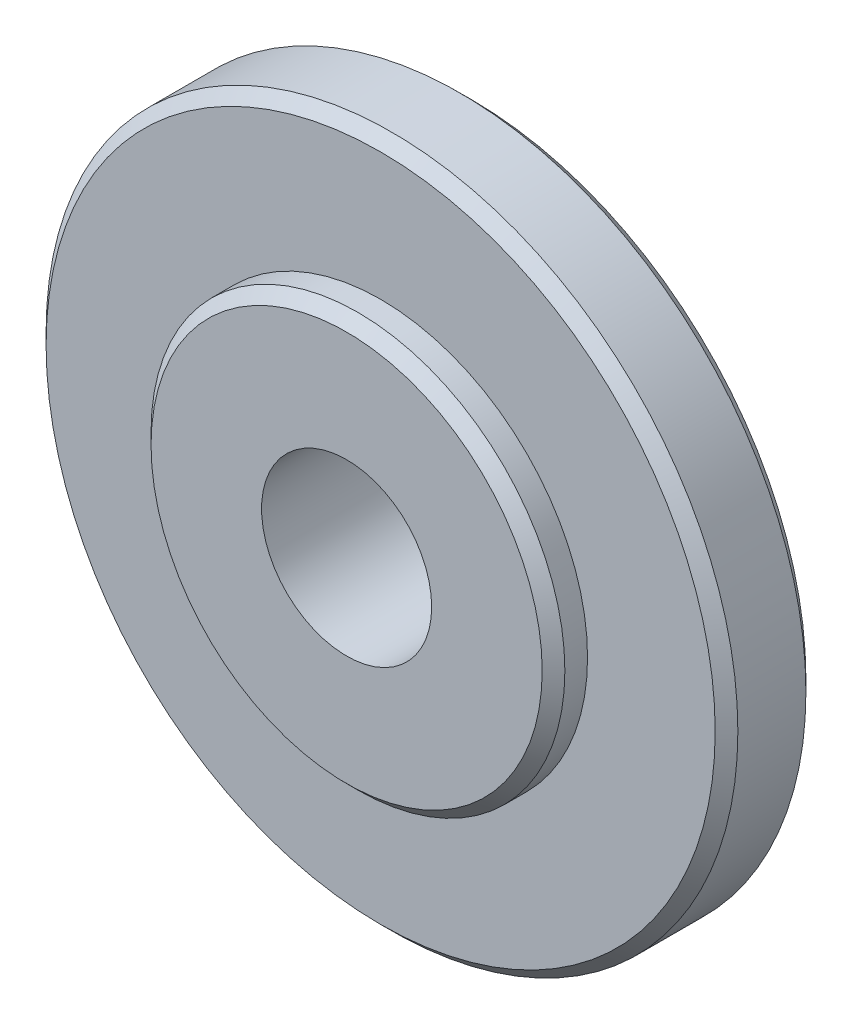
from build123d import *


with BuildPart() as part:
    # Esquisse1 → R_volution1 (revolve)
    with BuildSketch(Plane(origin=(0, 0, 0), x_dir=(0, 0, -1), z_dir=(1, 0, 0)), mode=Mode.PRIVATE) as r_volution1_sk:
        Polygon((1, 18.245161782), (3, 18.245161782), (3, 29.5), (4, 30.5), (10, 30.5), (11, 29.5), (11, 7.5), (0, 7.5), (0, 17.245161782), align=None)
    revolve(r_volution1_sk.sketch.rotate(Axis((0, 0, 0), (0, 0, -1)), 90), axis=Axis((0, 0, 0), (0, 0, -1)))


solid = part.part
